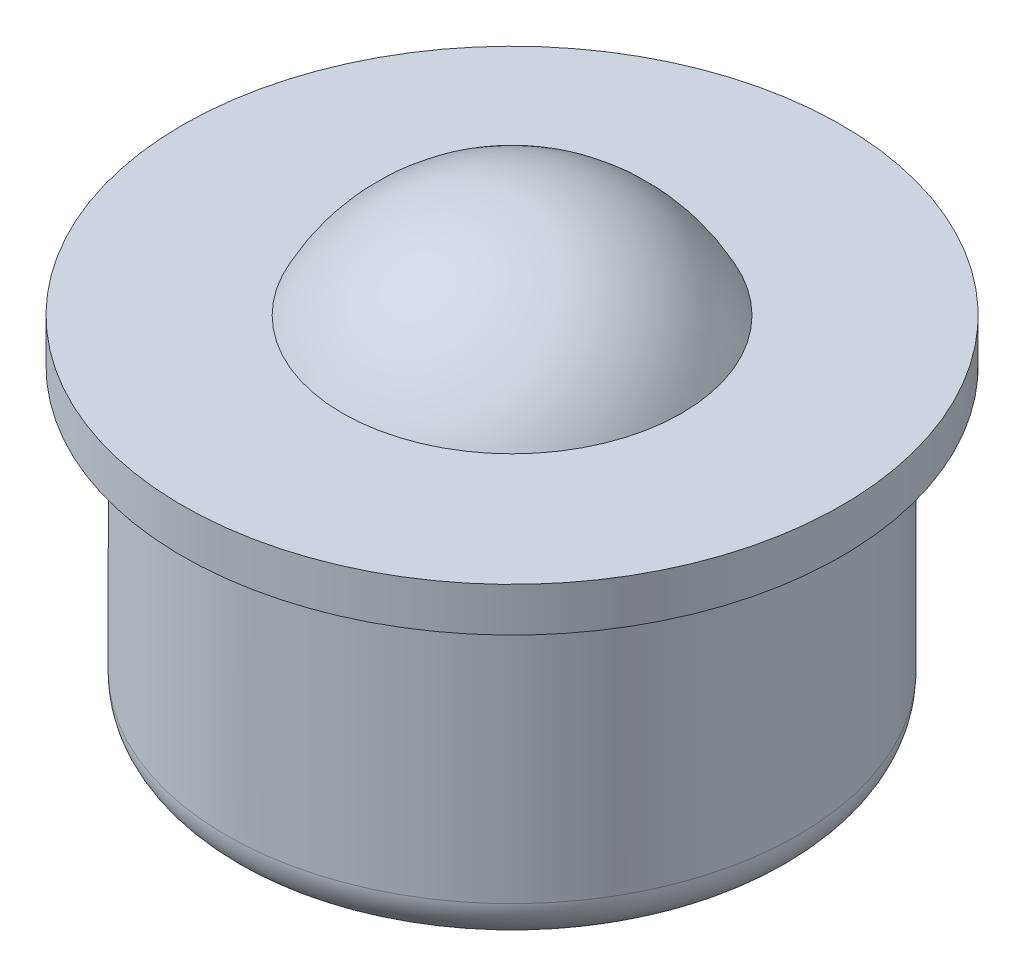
from build123d import *

# Parameters (mm, degrees)
SKETCH_2_R      = 7.5
EXTRUDE_1_DEPTH = 1


with BuildPart() as part:
    # Sketch 1 → Revolve 2 (revolve)
    with BuildSketch(Plane.XY, mode=Mode.PRIVATE) as revolve_2_sk:
        with BuildLine():
            Line((-5.5, -7), (0, -7))
            Line((0, -7), (0, 0))
            Line((0, 0), (-6.5, 0))
            Line((-6.5, 0), (-6.5, -6))
            ThreePointArc((-6.5, -6), (-6.207106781, -6.707106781), (-5.5, -7))
        make_face()
    revolve(revolve_2_sk.sketch.rotate(Axis((0, -7, 0), (0, 1, 0)), 180), axis=Axis((0, -7, 0), (0, 1, 0)))

    # Sketch 2 → Extrude 1 (add)
    with BuildSketch(Plane(origin=(0, 0, 0), x_dir=(1, 0, 0), z_dir=(0, 1, 0))):
        with Locations(Location((0, 0, 0), (0, 0, 180))):
            Circle(SKETCH_2_R)
    extrude(amount=EXTRUDE_1_DEPTH)

    # Sketch 579 → Revolve 715 (revolve)
    with BuildSketch(Plane(origin=(0, 0, 0), x_dir=(0, 0, -1), z_dir=(1, 0, 0))):
        with BuildLine():
            Line((0, 3.382133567), (0, 0.982133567))
            Line((0, 0.982133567), (0, -5.257866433))
            ThreePointArc((0, -5.257866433), (4.32, -0.937866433), (0, 3.382133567))
        make_face()
    revolve(axis=Axis((0, 3.382133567, 0), (0, -1, 0)))


solid = part.part
